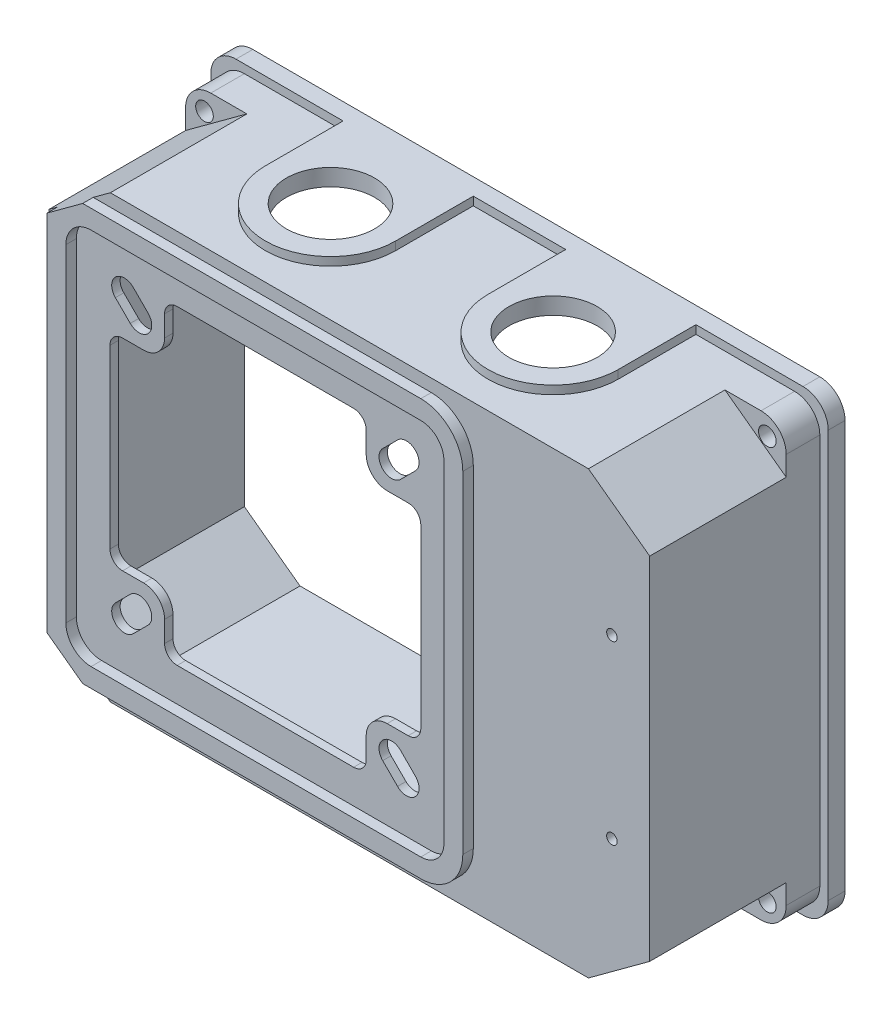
from build123d import *

# Parameters (mm, degrees)
EXTRUDE_1_DEPTH               = 40.5
SHELL_1_T                     = -2
SKETCH_2_W                    = 143
SKETCH_2_H                    = 105
EXTRUDE_2_DEPTH               = 8
SKETCH_3_W                    = 147
SKETCH_3_H                    = 109
SKETCH_3_W_2                  = 143
SKETCH_3_H_2                  = 105
EXTRUDE_3_DEPTH               = 4
SKETCH_4_W                    = 147
SKETCH_4_H                    = 109
EXTRUDE_4_DEPTH               = 4
FILLET_3_R                    = 6
FILLET_4_R                    = 6
EXTRUDE_5_DEPTH               = 2.5
SKETCH_6_R                    = 1
CUT_EXTRUDE_1_DEPTH           = 0.5
CUT_EXTRUDE_1_DRAFT           = -45
CUT_EXTRUDE_1_PROFILE_2_DEPTH = 0.5
CUT_EXTRUDE_1_PROFILE_2_DRAFT = -45
CUT_EXTRUDE_1_PROFILE_3_DEPTH = 0.5
CUT_EXTRUDE_1_PROFILE_3_DRAFT = -45
CUT_EXTRUDE_1_PROFILE_4_DEPTH = 0.5
CUT_EXTRUDE_1_PROFILE_4_DRAFT = -45
HOLE_WIZARD_M5_1_D            = 4.2
HOLE_WIZARD_M5_1_DEPTH        = 14
HOLE_WIZARD_M5_1_TIP          = 1.2618073
CUT_EXTRUDE_START             = 35
CUT_EXTRUDE_3_DEPTH           = 35
SKETCH_10_R                   = 0.1
CUT_EXTRUDE_4_DEPTH           = 35
EXTRUDE_6_DEPTH               = 42.5
CUT_EXTRUDE_START_2           = 32.5
CUT_EXTRUDE_5_DEPTH           = 32.5
CUT_EXTRUDE_6_DEPTH           = 10
CUT_EXTRUDE_7_DEPTH           = 10
EXTRUDE_7_DEPTH               = 3
EXTRUDE_7_TAPER               = 3
SKETCH_17_R                   = 3.5
EXTRUDE_8_DEPTH               = 3
HOLE_WIZARD_M3_1_D            = 2.5
HOLE_WIZARD_M3_1_DEPTH        = 8.5
HOLE_WIZARD_M3_1_TIP          = 0.751075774
EXTRUDE_9_DEPTH               = 2
HOLE_WIZARD_M24_1_D           = 21
HOLE_WIZARD_M24_1_DEPTH       = 63
HOLE_WIZARD_M24_1_TIP         = 6.3090365
EXTRUDE_START                 = 2
EXTRUDE_10_DEPTH              = 2
HOLE_WIZARD_M24_2_D           = 21
HOLE_WIZARD_M24_2_DEPTH       = 63
HOLE_WIZARD_M24_2_TIP         = 6.3090365


with BuildPart() as part:
    # Sketch 1 → Extrude 1 (new body)
    with BuildSketch(Plane.XY):
        Polygon((-60.289640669, -52.5), (60.289640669, -52.5), (71.5, -44.268617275), (71.5, 44.268617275), (60.289640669, 52.5), (-60.289640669, 52.5), (-71.5, 44.268617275), (-71.5, -44.268617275), align=None)
    extrude(amount=EXTRUDE_1_DEPTH)

    # Shell 1
    shell_1_openings = [part.faces().sort_by_distance(p)[0] for p in [
        (0, 0, 0),
    ]]
    offset(amount=SHELL_1_T, openings=shell_1_openings, kind=Kind.INTERSECTION)

    # Sketch 2 → Extrude 2 (add)
    with BuildSketch(Plane(origin=(0, 0, 0), x_dir=(-1, 0, 0), z_dir=(0, 0, -1))):
        Rectangle(SKETCH_2_W, SKETCH_2_H)
        Polygon((-59.634228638, 50.5), (-69.5, 43.255902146), (-69.5, -43.255902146), (-59.634228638, -50.5), (59.634228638, -50.5), (69.5, -43.255902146), (69.5, 43.255902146), (59.634228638, 50.5), align=None, mode=Mode.SUBTRACT)
    extrude(amount=-EXTRUDE_2_DEPTH)



with BuildPart() as body_2:
    # Sketch 3 → Extrude 3 (new body)
    with BuildSketch(Plane(origin=(0, 0, 0), x_dir=(-1, 0, 0), z_dir=(0, 0, -1))):
        Rectangle(SKETCH_3_W, SKETCH_3_H)
        Rectangle(SKETCH_3_W_2, SKETCH_3_H_2, mode=Mode.SUBTRACT)
    extrude(amount=EXTRUDE_3_DEPTH)


with BuildPart() as part_1:
    add(part.part)

    add(body_2.part)  # Extrude 4 merges body 2
    # Sketch 4 → Extrude 4 (add)
    with BuildSketch(Plane(origin=(0, 0, 0), x_dir=(-1, 0, 0), z_dir=(0, 0, -1))):
        Rectangle(SKETCH_4_W, SKETCH_4_H)
        Polygon((59.634228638, 50.5), (-59.634228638, 50.5), (-69.5, 43.255902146), (-69.5, -43.255902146), (-59.634228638, -50.5), (59.634228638, -50.5), (69.5, -43.255902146), (69.5, 43.255902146), align=None, mode=Mode.SUBTRACT)
    extrude(amount=EXTRUDE_4_DEPTH)

    # Fillet 3
    fillet_3_edges = [part_1.edges().sort_by_distance(p)[0] for p in [
        (71.5, 52.5, 4),
        (-71.5, 52.5, 4),
        (-71.5, -52.5, 4),
        (71.5, -52.5, 4),
    ]]
    fillet(fillet_3_edges, radius=FILLET_3_R)

    # Fillet 4
    fillet_4_edges = [part_1.edges().sort_by_distance(p)[0] for p in [
        (73.5, 54.5, -2),
        (73.5, -54.5, -2),
        (-73.5, -54.5, -2),
        (-73.5, 54.5, -2),
    ]]
    fillet(fillet_4_edges, radius=FILLET_4_R)

    # Sketch 5 → Extrude 5 (add)
    with BuildSketch(Plane.XY.offset(40.5)):
        with BuildLine():
            Line((-64.375354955, 49.5), (19.5, 49.5))
            ThreePointArc((19.5, 49.5), (26.571067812, 46.571067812), (29.5, 39.5))
            Line((29.5, 39.5), (29.5, -39.5))
            ThreePointArc((29.5, -39.5), (26.571067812, -46.571067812), (19.5, -49.5))
            Line((19.5, -49.5), (-64.375354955, -49.5))
            Line((-64.375354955, -49.5), (-69.5, -45.737148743))
            Line((-69.5, -45.737148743), (-69.5, 45.737148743))
            Line((-69.5, 45.737148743), (-64.375354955, 49.5))
        make_face()
        with BuildLine():
            Line((-59, 45), (19.5, 45))
            ThreePointArc((19.5, 45), (23.389087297, 43.389087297), (25, 39.5))
            Line((25, 39.5), (25, -39.5))
            ThreePointArc((25, -39.5), (23.389087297, -43.389087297), (19.5, -45))
            Line((19.5, -45), (-59, -45))
            ThreePointArc((-59, -45), (-63.242640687, -43.242640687), (-65, -39))
            Line((-65, -39), (-65, 39))
            ThreePointArc((-65, 39), (-63.242640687, 43.242640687), (-59, 45))
        make_face(mode=Mode.SUBTRACT)
    extrude(amount=EXTRUDE_5_DEPTH)


with BuildPart() as cut_extrude_1_tool:
    # Sketch 6 → Cut-Extrude 1 (with draft: the straight prism first)
    with BuildSketch(Plane(origin=(0, 0, -4), x_dir=(-1, 0, 0), z_dir=(0, 0, -1))):
        with Locations((67, 48)):
            Circle(SKETCH_6_R)
    extrude(amount=-CUT_EXTRUDE_1_DEPTH)
    # Cut-Extrude 1: the draft: its side faces are tilted about the plane it starts from
    cut_extrude_1_sides = [cut_extrude_1_tool.faces().sort_by_distance(p)[0] for p in [
        (-66, 48, -3.75),
    ]]
    draft(cut_extrude_1_sides, Plane(origin=(0, 0, -4), x_dir=(-1, 0, 0), z_dir=(0, 0, -1)), CUT_EXTRUDE_1_DRAFT)


with BuildPart() as part_2:
    add(part_1.part)

    # Cut-Extrude 1: cut by cut_extrude_1_tool
    add(cut_extrude_1_tool.part, mode=Mode.SUBTRACT)


with BuildPart() as cut_extrude_1_profile_2_tool:
    # Sketch 6 → Cut-Extrude 1 profile 2 (with draft: the straight prism first)
    with BuildSketch(Plane(origin=(0, 0, -4), x_dir=(-1, 0, 0), z_dir=(0, 0, -1))):
        with Locations((-67, 48)):
            Circle(SKETCH_6_R)
    extrude(amount=-CUT_EXTRUDE_1_PROFILE_2_DEPTH)
    # Cut-Extrude 1 profile 2: the draft: its side faces are tilted about the plane it starts from
    cut_extrude_1_profile_2_sides = [cut_extrude_1_profile_2_tool.faces().sort_by_distance(p)[0] for p in [
        (68, 48, -3.75),
    ]]
    draft(cut_extrude_1_profile_2_sides, Plane(origin=(0, 0, -4), x_dir=(-1, 0, 0), z_dir=(0, 0, -1)), CUT_EXTRUDE_1_PROFILE_2_DRAFT)


with BuildPart() as part_3:
    add(part_2.part)

    # Cut-Extrude 1 profile 2: cut by cut_extrude_1_profile_2_tool
    add(cut_extrude_1_profile_2_tool.part, mode=Mode.SUBTRACT)


with BuildPart() as cut_extrude_1_profile_3_tool:
    # Sketch 6 → Cut-Extrude 1 profile 3 (with draft: the straight prism first)
    with BuildSketch(Plane(origin=(0, 0, -4), x_dir=(-1, 0, 0), z_dir=(0, 0, -1))):
        with Locations((-67, -48)):
            Circle(SKETCH_6_R)
    extrude(amount=-CUT_EXTRUDE_1_PROFILE_3_DEPTH)
    # Cut-Extrude 1 profile 3: the draft: its side faces are tilted about the plane it starts from
    cut_extrude_1_profile_3_sides = [cut_extrude_1_profile_3_tool.faces().sort_by_distance(p)[0] for p in [
        (68, -48, -3.75),
    ]]
    draft(cut_extrude_1_profile_3_sides, Plane(origin=(0, 0, -4), x_dir=(-1, 0, 0), z_dir=(0, 0, -1)), CUT_EXTRUDE_1_PROFILE_3_DRAFT)


with BuildPart() as part_4:
    add(part_3.part)

    # Cut-Extrude 1 profile 3: cut by cut_extrude_1_profile_3_tool
    add(cut_extrude_1_profile_3_tool.part, mode=Mode.SUBTRACT)


with BuildPart() as cut_extrude_1_profile_4_tool:
    # Sketch 6 → Cut-Extrude 1 profile 4 (with draft: the straight prism first)
    with BuildSketch(Plane(origin=(0, 0, -4), x_dir=(-1, 0, 0), z_dir=(0, 0, -1))):
        with Locations((67, -48)):
            Circle(SKETCH_6_R)
    extrude(amount=-CUT_EXTRUDE_1_PROFILE_4_DEPTH)
    # Cut-Extrude 1 profile 4: the draft: its side faces are tilted about the plane it starts from
    cut_extrude_1_profile_4_sides = [cut_extrude_1_profile_4_tool.faces().sort_by_distance(p)[0] for p in [
        (-66, -48, -3.75),
    ]]
    draft(cut_extrude_1_profile_4_sides, Plane(origin=(0, 0, -4), x_dir=(-1, 0, 0), z_dir=(0, 0, -1)), CUT_EXTRUDE_1_PROFILE_4_DRAFT)


with BuildPart() as part_5:
    add(part_4.part)

    # Cut-Extrude 1 profile 4: cut by cut_extrude_1_profile_4_tool
    add(cut_extrude_1_profile_4_tool.part, mode=Mode.SUBTRACT)

    # Hole Wizard M5 _1
    with Locations(Plane(origin=(0, 0, -4), x_dir=(-1, 0, 0), z_dir=(0, 0, -1))):
        with Locations((67, 48), (67, -48), (-67, -48), (-67, 48)):
            Hole(HOLE_WIZARD_M5_1_D / 2, depth=HOLE_WIZARD_M5_1_DEPTH)
            with Locations((0, 0, -(HOLE_WIZARD_M5_1_DEPTH + HOLE_WIZARD_M5_1_TIP / 2))):  # 118° drill point
                Cone(0, HOLE_WIZARD_M5_1_D / 2, HOLE_WIZARD_M5_1_TIP, mode=Mode.SUBTRACT)

    # Sketch 9 → Cut-Extrude 3 (cut)
    with BuildSketch(Plane.XY.offset(8).offset(CUT_EXTRUDE_START)):
        with BuildLine():
            Line((-71.5, 41.787370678), (-56.910419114, 52.5))
            Line((-56.910419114, 52.5), (-65.5, 52.5))
            ThreePointArc((-65.5, 52.5), (-69.742640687, 50.742640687), (-71.5, 46.5))
            Line((-71.5, 46.5), (-71.5, 41.787370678))
        make_face()
    extrude(amount=-CUT_EXTRUDE_3_DEPTH, mode=Mode.SUBTRACT)

    # Sketch 10 → Cut-Extrude 4 (cut)
    with BuildSketch(Plane.XY.offset(8).offset(CUT_EXTRUDE_START)):
        with BuildLine():
            Line((-71.5, -41.787370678), (-71.5, -46.5))
            ThreePointArc((-71.5, -46.5), (-69.742640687, -50.742640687), (-65.5, -52.5))
            Line((-65.5, -52.5), (-56.910419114, -52.5))
            Line((-56.910419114, -52.5), (-71.5, -41.787370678))
        make_face()
        with Locations((-67, -48)):
            Circle(SKETCH_10_R, mode=Mode.SUBTRACT)
    extrude(amount=-CUT_EXTRUDE_4_DEPTH, mode=Mode.SUBTRACT)

    # Sketch 11 → Extrude 6 (add)
    with BuildSketch(Plane(origin=(0, 0, 38.5), x_dir=(-1, 0, 0), z_dir=(0, 0, -1))):
        Polygon((-56.255007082, 50.5), (-69.5, 40.77465555), (-69.5, 43.255902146), (-59.634228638, 50.5), align=None)
        Polygon((69.5, 40.77465555), (56.255007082, 50.5), (59.634228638, 50.5), (69.5, 43.255902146), align=None)
        Polygon((53.531197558, -52.5), (71.5, -39.306124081), (71.5, -41.787370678), (56.910419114, -52.5), align=None)
        Polygon((-69.5, -40.77465555), (-56.255007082, -50.5), (-59.634228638, -50.5), (-69.5, -43.255902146), align=None)
    extrude(amount=EXTRUDE_6_DEPTH)

    # Sketch 12 → Cut-Extrude 5 (cut)
    with BuildSketch(Plane.XY.offset(8).offset(CUT_EXTRUDE_START_2)):
        with BuildLine():
            Line((71.5, 41.787370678), (71.5, 46.5))
            ThreePointArc((71.5, 46.5), (69.742640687, 50.742640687), (65.5, 52.5))
            Line((65.5, 52.5), (56.910419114, 52.5))
            Line((56.910419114, 52.5), (71.5, 41.787370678))
        make_face()
        with BuildLine():
            Line((56.910419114, -52.5), (65.5, -52.5))
            ThreePointArc((65.5, -52.5), (69.742640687, -50.742640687), (71.5, -46.5))
            Line((71.5, -46.5), (71.5, -41.787370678))
            Line((71.5, -41.787370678), (56.910419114, -52.5))
        make_face()
    extrude(amount=-CUT_EXTRUDE_5_DEPTH, mode=Mode.SUBTRACT)

    # Sketch 14 → Cut-Extrude 6 (cut)
    with BuildSketch(Plane.XY.offset(40.5)):
        with BuildLine():
            Line((1, 37), (-41, 37))
            ThreePointArc((-41, 37), (-43.121320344, 36.121320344), (-44, 34))
            Line((-44, 34), (-44, 29))
            ThreePointArc((-44, 29), (-45.464466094, 25.464466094), (-49, 24))
            Line((-49, 24), (-54, 24))
            ThreePointArc((-54, 24), (-56.121320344, 23.121320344), (-57, 21))
            Line((-57, 21), (-57, -21))
            ThreePointArc((-57, -21), (-56.121320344, -23.121320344), (-54, -24))
            Line((-54, -24), (-49, -24))
            ThreePointArc((-49, -24), (-45.464466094, -25.464466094), (-44, -29))
            Line((-44, -29), (-44, -34))
            ThreePointArc((-44, -34), (-43.121320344, -36.121320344), (-41, -37))
            Line((-41, -37), (1, -37))
            ThreePointArc((1, -37), (3.121320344, -36.121320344), (4, -34))
            Line((4, -34), (4, -29))
            ThreePointArc((4, -29), (5.464466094, -25.464466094), (9, -24))
            Line((9, -24), (14, -24))
            ThreePointArc((14, -24), (16.121320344, -23.121320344), (17, -21))
            Line((17, -21), (17, 21))
            ThreePointArc((17, 21), (16.121320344, 23.121320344), (14, 24))
            Line((14, 24), (9, 24))
            ThreePointArc((9, 24), (5.464466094, 25.464466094), (4, 29))
            Line((4, 29), (4, 34))
            ThreePointArc((4, 34), (3.121320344, 36.121320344), (1, 37))
        make_face()
    extrude(amount=-CUT_EXTRUDE_6_DEPTH, mode=Mode.SUBTRACT)

    # Sketch 15 → Cut-Extrude 7 (cut)
    with BuildSketch(Plane.XY.offset(40.5)):
        with BuildLine():
            Line((7.930717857, 32.173358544), (11.466251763, 35.70889245))
            ThreePointArc((11.466251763, 35.70889245), (15.70889245, 35.70889245), (15.70889245, 31.466251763))
            Line((15.70889245, 31.466251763), (12.173358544, 27.930717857))
            ThreePointArc((12.173358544, 27.930717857), (7.930717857, 27.930717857), (7.930717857, 32.173358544))
        make_face()
        with BuildLine():
            Line((12.173358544, -27.930717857), (15.70889245, -31.466251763))
            ThreePointArc((15.70889245, -31.466251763), (15.70889245, -35.70889245), (11.466251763, -35.70889245))
            Line((11.466251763, -35.70889245), (7.930717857, -32.173358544))
            ThreePointArc((7.930717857, -32.173358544), (7.930717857, -27.930717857), (12.173358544, -27.930717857))
        make_face()
        with BuildLine():
            Line((-47.930717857, -32.173358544), (-51.466251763, -35.70889245))
            ThreePointArc((-51.466251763, -35.70889245), (-55.70889245, -35.70889245), (-55.70889245, -31.466251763))
            Line((-55.70889245, -31.466251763), (-52.173358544, -27.930717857))
            ThreePointArc((-52.173358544, -27.930717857), (-47.930717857, -27.930717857), (-47.930717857, -32.173358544))
        make_face()
        with BuildLine():
            Line((-52.173358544, 27.930717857), (-55.70889245, 31.466251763))
            ThreePointArc((-55.70889245, 31.466251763), (-55.70889245, 35.70889245), (-51.466251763, 35.70889245))
            Line((-51.466251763, 35.70889245), (-47.930717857, 32.173358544))
            ThreePointArc((-47.930717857, 32.173358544), (-47.930717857, 27.930717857), (-52.173358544, 27.930717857))
        make_face()
    extrude(amount=-CUT_EXTRUDE_7_DEPTH, mode=Mode.SUBTRACT)

    # Sketch 16 → Extrude 7 (add)
    with BuildSketch(Plane(origin=(0, 0, 38.5), x_dir=(-1, 0, 0), z_dir=(0, 0, -1))):
        with BuildLine():
            ThreePointArc((-30, 30), (-36.5, 36.5), (-43, 30))
            Line((-43, 30), (-43, 14.082480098))
            ThreePointArc((-43, 14.082480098), (-43.292893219, 13.375373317), (-44, 13.082480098))
            Line((-44, 13.082480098), (-45, 13.082480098))
            ThreePointArc((-45, 13.082480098), (-46.414213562, 12.496693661), (-47, 11.082480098))
            Line((-47, 11.082480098), (-47, 6.708203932))
            ThreePointArc((-47, 6.708203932), (-47.396432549, 5.512975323), (-48.428571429, 4.791574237))
            ThreePointArc((-48.428571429, 4.791574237), (-52, 0), (-48.428571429, -4.791574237))
            ThreePointArc((-48.428571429, -4.791574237), (-47.396432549, -5.512975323), (-47, -6.708203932))
            Line((-47, -6.708203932), (-47, -8.917519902))
            ThreePointArc((-47, -8.917519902), (-46.414213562, -10.331733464), (-45, -10.917519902))
            Line((-45, -10.917519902), (-44, -10.917519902))
            ThreePointArc((-44, -10.917519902), (-43.292893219, -11.210413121), (-43, -11.917519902))
            Line((-43, -11.917519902), (-43, -30))
            ThreePointArc((-43, -30), (-36.5, -36.5), (-30, -30))
            Line((-30, -30), (-30, -7))
            ThreePointArc((-30, -7), (-29.414213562, -5.585786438), (-28, -5))
            Line((-28, -5), (-27, -5))
            ThreePointArc((-27, -5), (-22, 0), (-27, 5))
            Line((-27, 5), (-28, 5))
            ThreePointArc((-28, 5), (-29.414213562, 5.585786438), (-30, 7))
            Line((-30, 7), (-30, 30))
        make_face()
    extrude(amount=EXTRUDE_7_DEPTH, taper=EXTRUDE_7_TAPER)

    # Sketch 17 → Extrude 8 (add)
    with BuildSketch(Plane(origin=(0, 0, 38.5), x_dir=(-1, 0, 0), z_dir=(0, 0, -1))):
        with Locations(Location((-62.5, 21, 0), (0, 0, 180))):
            Circle(SKETCH_17_R)
        with Locations(Location((-62.5, -21, 0), (0, 0, 180))):
            Circle(SKETCH_17_R)
    extrude(amount=EXTRUDE_8_DEPTH)

    # Hole Wizard M3 _1
    with Locations(Plane(origin=(0, 0, 35.5), x_dir=(-1, 0, 0), z_dir=(0, 0, -1))):
        with Locations((-62.5, 21), (-62.5, -21)):
            Hole(HOLE_WIZARD_M3_1_D / 2, depth=HOLE_WIZARD_M3_1_DEPTH)
            with Locations((0, 0, -(HOLE_WIZARD_M3_1_DEPTH + HOLE_WIZARD_M3_1_TIP / 2))):  # 118° drill point
                Cone(0, HOLE_WIZARD_M3_1_D / 2, HOLE_WIZARD_M3_1_TIP, mode=Mode.SUBTRACT)

    # Sketch 20 → Extrude 9 (add)
    with BuildSketch(Plane(origin=(0, 52.5, 0), x_dir=(1, 0, 0), z_dir=(0, 1, 0))):
        with BuildLine():
            Line((-42, 4), (-11, 4))
            Line((-11, 4), (-11, -18.5))
            ThreePointArc((-11, -18.5), (-26.5, -34), (-42, -18.5))
            Line((-42, -18.5), (-42, 4))
        make_face()
        with BuildLine():
            Line((11, 4), (11, -18.5))
            ThreePointArc((11, -18.5), (26.5, -34), (42, -18.5))
            Line((42, -18.5), (42, 4))
            Line((42, 4), (11, 4))
        make_face()
    extrude(amount=EXTRUDE_9_DEPTH)

    # Hole Wizard M24 _1
    with Locations(Plane(origin=(0, 54.5, 0), x_dir=(1, 0, 0), z_dir=(0, 1, 0))):
        with Locations((26.5, -18.5), (-26.5, -18.5)):
            Hole(HOLE_WIZARD_M24_1_D / 2, depth=HOLE_WIZARD_M24_1_DEPTH)
            with Locations((0, 0, -(HOLE_WIZARD_M24_1_DEPTH + HOLE_WIZARD_M24_1_TIP / 2))):  # 118° drill point
                Cone(0, HOLE_WIZARD_M24_1_D / 2, HOLE_WIZARD_M24_1_TIP, mode=Mode.SUBTRACT)

    # Sketch 23 → Extrude 10 (add)
    with BuildSketch(Plane.XZ.offset(52.5).offset(EXTRUDE_START)):
        with BuildLine():
            Line((11, -4), (42, -4))
            Line((42, -4), (42, 18.5))
            ThreePointArc((42, 18.5), (26.5, 34), (11, 18.5))
            Line((11, 18.5), (11, -4))
        make_face()
        with BuildLine():
            Line((-11, -4), (-42, -4))
            Line((-42, -4), (-42, 18.5))
            ThreePointArc((-42, 18.5), (-26.5, 34), (-11, 18.5))
            Line((-11, 18.5), (-11, -4))
        make_face()
    extrude(amount=-EXTRUDE_10_DEPTH)

    # Hole Wizard M24 _2
    with Locations(Plane(origin=(0, -54.5, 0), x_dir=(-1, 0, 0), z_dir=(0, -1, 0))):
        with Locations((-26.5, -18.5)):
            Hole(HOLE_WIZARD_M24_2_D / 2, depth=HOLE_WIZARD_M24_2_DEPTH)
            with Locations((0, 0, -(HOLE_WIZARD_M24_2_DEPTH + HOLE_WIZARD_M24_2_TIP / 2))):  # 118° drill point
                Cone(0, HOLE_WIZARD_M24_2_D / 2, HOLE_WIZARD_M24_2_TIP, mode=Mode.SUBTRACT)


solid = part_5.part
